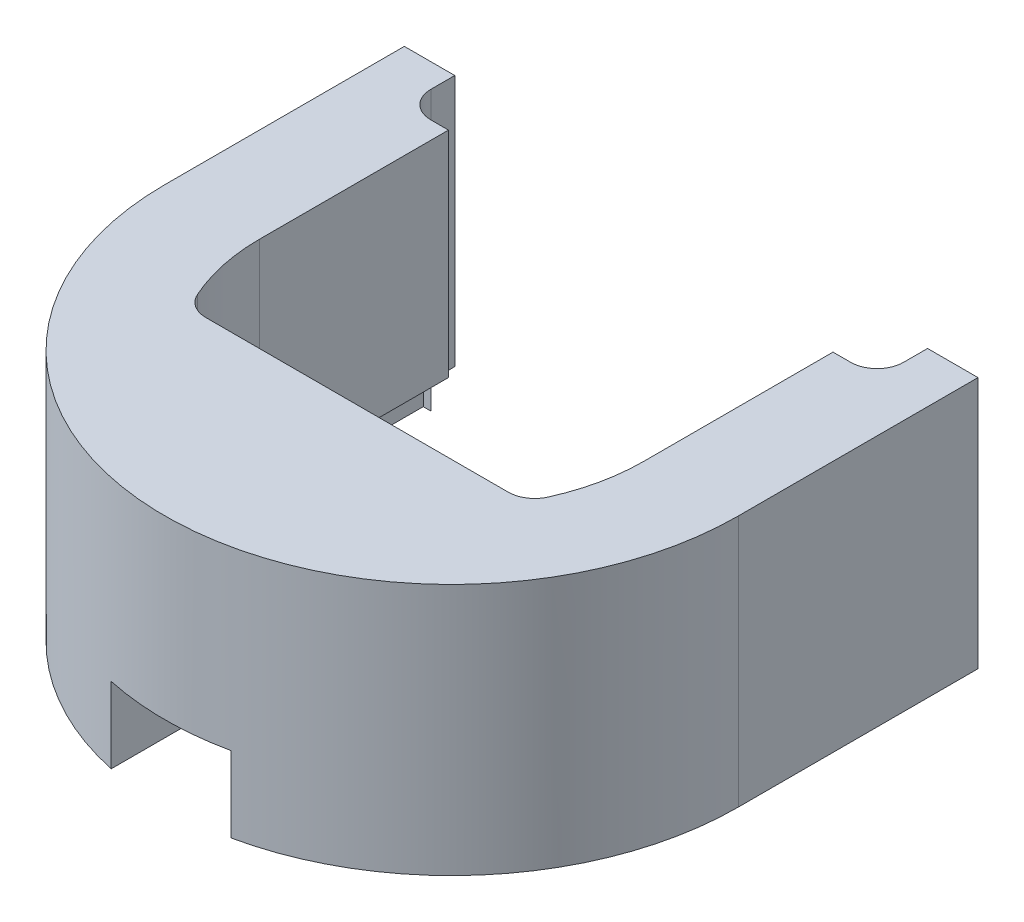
from build123d import *

# Parameters (mm, degrees)
BOSS_EXTRU_1_DEPTH      = 40
ESQUISSE3_R             = 3
ENL_V_MAT_EXTRU_2_DEPTH = 6
ESQUISSE4_W             = 19
ESQUISSE4_H             = 12
ENL_V_MAT_EXTRU_3_DEPTH = 32


with BuildPart() as part:
    # Esquisse1 → Boss.-Extru.1 (new body)
    with BuildSketch(Plane(origin=(0, 0, 0), x_dir=(1, 0, 0), z_dir=(0, 1, 0))):
        with BuildLine():
            Line((-23.980200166, -45), (23.980200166, -45))
            ThreePointArc((23.980200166, -45), (26.260134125, -44.327307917), (27.809737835, -42.524714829))
            ThreePointArc((27.809737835, -42.524714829), (29.819850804, -36.405193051), (30.5, -30))
            Line((30.5, -30), (30.5, 0))
            Line((30.5, 0), (33.3, 0))
            ThreePointArc((33.3, 0), (36.269848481, 1.230151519), (37.5, 4.2))
            Line((37.5, 4.2), (37.5, 8))
            Line((37.5, 8), (45.5, 8))
            Line((45.5, 8), (45.5, -30))
            ThreePointArc((45.5, -30), (0, -75.5), (-45.5, -30))
            Line((-45.5, -30), (-45.5, 8))
            Line((-45.5, 8), (-37.5, 8))
            Line((-37.5, 8), (-37.5, 4.2))
            ThreePointArc((-37.5, 4.2), (-36.269848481, 1.230151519), (-33.3, 0))
            Line((-33.3, 0), (-30.5, 0))
            Line((-30.5, 0), (-30.5, -30))
            ThreePointArc((-30.5, -30), (-29.819850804, -36.405193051), (-27.809737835, -42.524714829))
            ThreePointArc((-27.809737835, -42.524714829), (-26.260134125, -44.327307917), (-23.980200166, -45))
        make_face()
    extrude(amount=BOSS_EXTRU_1_DEPTH)

    # Esquisse3 → Enl_v. mat.-Extru.2 (cut)
    with BuildSketch(Plane.XZ):
        with BuildLine():
            Line((30.5, 30), (30.5, 0))
            Line((30.5, 0), (34.5, 0))
            Line((34.5, 0), (34.5, 30))
            ThreePointArc((34.5, 30), (31.039349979, 45.060171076), (21.351666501, 57.099009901))
            ThreePointArc((21.351666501, 57.099009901), (20.127861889, 57.768365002), (18.752333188, 58))
            Line((18.752333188, 58), (-18.752333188, 58))
            ThreePointArc((-18.752333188, 58), (-20.127861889, 57.768365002), (-21.351666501, 57.099009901))
            ThreePointArc((-21.351666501, 57.099009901), (-31.039349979, 45.060171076), (-34.5, 30))
            Line((-34.5, 30), (-34.5, 0))
            Line((-34.5, 0), (-30.5, 0))
            Line((-30.5, 0), (-30.5, 30))
            ThreePointArc((-30.5, 30), (-29.819850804, 36.405193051), (-27.809737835, 42.524714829))
            ThreePointArc((-27.809737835, 42.524714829), (-26.260134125, 44.327307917), (-23.980200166, 45))
            Line((-23.980200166, 45), (23.980200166, 45))
            ThreePointArc((23.980200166, 45), (26.260134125, 44.327307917), (27.809737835, 42.524714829))
            ThreePointArc((27.809737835, 42.524714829), (29.819850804, 36.405193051), (30.5, 30))
        make_face()
        with Locations(Location((18, 51, 0), (0, 0, 270))):
            Circle(ESQUISSE3_R, mode=Mode.SUBTRACT)
        with Locations(Location((-18, 51, 0), (0, 0, 90))):
            Circle(ESQUISSE3_R, mode=Mode.SUBTRACT)
    extrude(amount=-ENL_V_MAT_EXTRU_2_DEPTH, mode=Mode.SUBTRACT)

    # Esquisse4 → Enl_v. mat.-Extru.3 (cut)
    with BuildSketch(Plane(origin=(0, 0, 45), x_dir=(-1, 0, 0), z_dir=(0, 0, -1))):
        with Locations((0, 6)):
            Rectangle(ESQUISSE4_W, ESQUISSE4_H)
    extrude(amount=-ENL_V_MAT_EXTRU_3_DEPTH, mode=Mode.SUBTRACT)


solid = part.part
